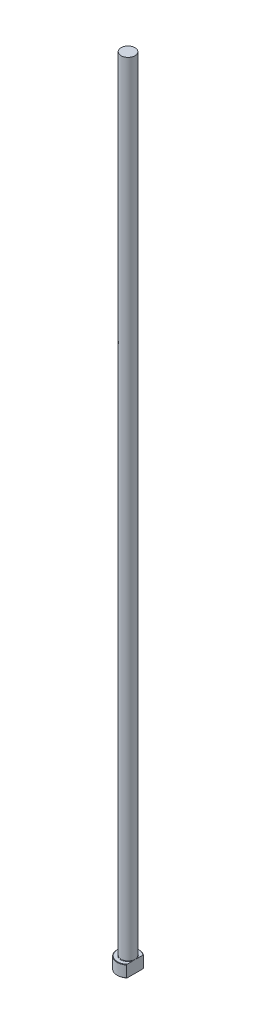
from build123d import *
from build123d.topology import SkipClean

# Parameters (mm, degrees)
CHAMFER1_SIZE    = 0.2
FILLET1_R        = 0.2
KEYED_HEAD_DEPTH = 401.075617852


with BuildPart() as part:
    # Sketch1 → Revolve1 (revolve)
    with BuildSketch(Plane.XY, mode=Mode.PRIVATE) as revolve1_sk:
        Polygon((0, 0), (-5.5, 0), (-5.5, 6), (-3.5, 6), (-3.5, 400), (0, 400), align=None)
    revolve(revolve1_sk.sketch.rotate(Axis((0, 259.958771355, 0), (0, -1, 0)), 270), axis=Axis((0, 259.958771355, 0), (0, -1, 0)))

    # Chamfer1
    chamfer1_edges = [part.edges().sort_by_distance(p)[0] for p in [
        (0, 6, -5.5),
        (0, 0, -5.5),
    ]]
    chamfer(chamfer1_edges, length=CHAMFER1_SIZE)

    # Fillet1
    fillet1_edges = [part.edges().sort_by_distance(p)[0] for p in [
        (0, 6, -3.5),
    ]]
    fillet(fillet1_edges, radius=FILLET1_R)

    # Sketch2 → KEYED HEAD (cut, through all)
    with SkipClean():  # the faces are left unmerged after this step: merging them gives an invalid solid
        with BuildSketch(Plane(origin=(0, 0, 0), x_dir=(1, 0, 0), z_dir=(0, 1, 0))):
            with BuildLine():
                Line((3.5, -4.242640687), (3.5, 4.242640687))
                ThreePointArc((3.5, 4.242640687), (5.5, 0), (3.5, -4.242640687))
            make_face()
        extrude(amount=KEYED_HEAD_DEPTH, mode=Mode.SUBTRACT)


solid = part.part
